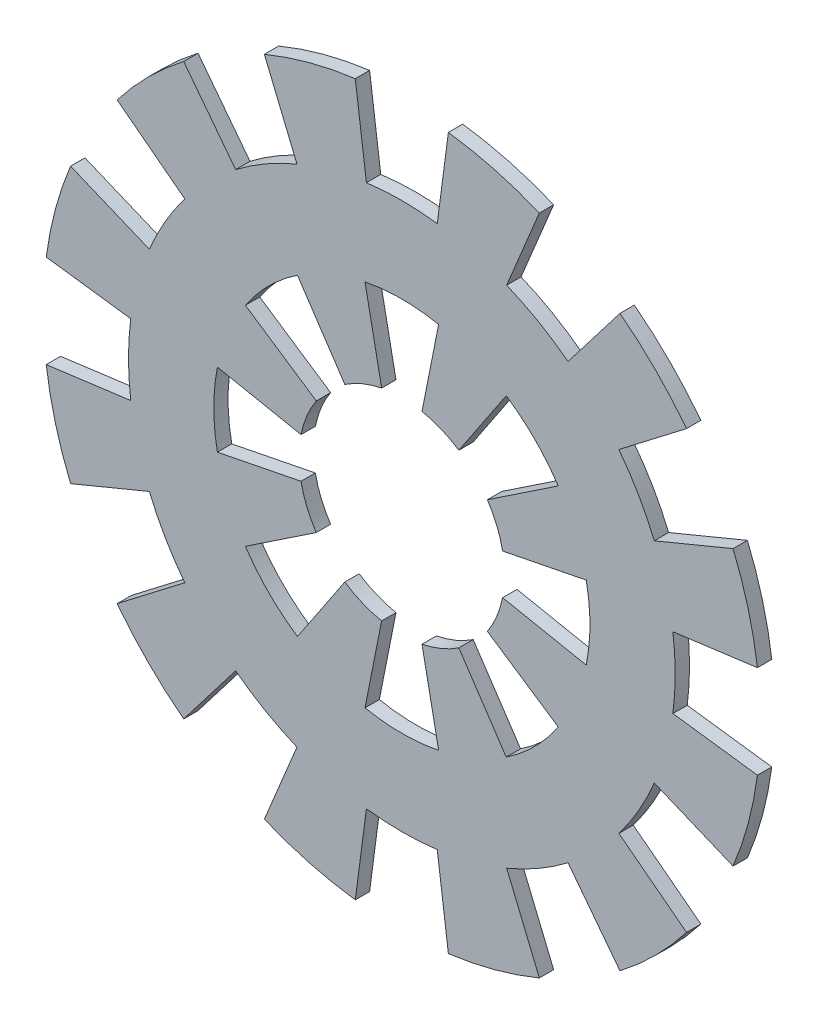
from build123d import *

# Parameters (mm, degrees)
BODYSKE_W        = 5.35
BODYSKE_H        = 0.3
TOOTHCUTIN_DEPTH = 11.61084351
TOOTHINPAT_COUNT = 8
TOOTHCUTEX_DEPTH = 11.61084351
TOOTHEXPAT_COUNT = 12


with BuildPart() as part:
    # BodySke → BaseBody (revolve)
    with BuildSketch(Plane(origin=(0, 0, 0), x_dir=(1, 0, 0), z_dir=(0, 1, 0))):
        with Locations((4.825, 0.15)):
            Rectangle(BODYSKE_W, BODYSKE_H)
    revolve(axis=Axis((0, 0, 0), (0, 0, -1)))

    # ToothInSke → ToothCutIn (cut, through all)
    with BuildSketch(Plane.XY):
        with BuildLine():
            Line((-0.770062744, 3.857215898), (-0.422151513, 2.108148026))
            Line((-0.422151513, 2.108148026), (0.422151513, 2.108148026))
            Line((0.422151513, 2.108148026), (0.770062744, 3.857215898))
            ThreePointArc((0.770062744, 3.857215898), (0, 3.933333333), (-0.770062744, 3.857215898))
        make_face()
    toothcutin = extrude(amount=-TOOTHCUTIN_DEPTH, mode=Mode.SUBTRACT)

    # ToothInPat: ToothCutIn ×8 about axis
    toothinpat_axis = Axis((0, 0, 0), (0, 0, 1))
    for i in range(1, TOOTHINPAT_COUNT):
        add(toothcutin.rotate(toothinpat_axis, i * 360 / TOOTHINPAT_COUNT), mode=Mode.SUBTRACT)

    # ToothExSke → ToothCutEx (cut, through all)
    with BuildSketch(Plane.XY):
        with BuildLine():
            Line((7.5, -0.981747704), (7.5, 0.981747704))
            Line((7.5, 0.981747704), (5.668487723, 0.740624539))
            ThreePointArc((5.668487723, 0.740624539), (5.716666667, 0), (5.668487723, -0.740624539))
            Line((5.668487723, -0.740624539), (7.5, -0.981747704))
        make_face()
    toothcutex = extrude(amount=-TOOTHCUTEX_DEPTH, mode=Mode.SUBTRACT)

    # ToothExPat: ToothCutEx ×12 about axis
    toothexpat_axis = Axis((0, 0, 0), (0, 0, 1))
    for i in range(1, TOOTHEXPAT_COUNT):
        add(toothcutex.rotate(toothexpat_axis, i * 360 / TOOTHEXPAT_COUNT), mode=Mode.SUBTRACT)


solid = part.part
